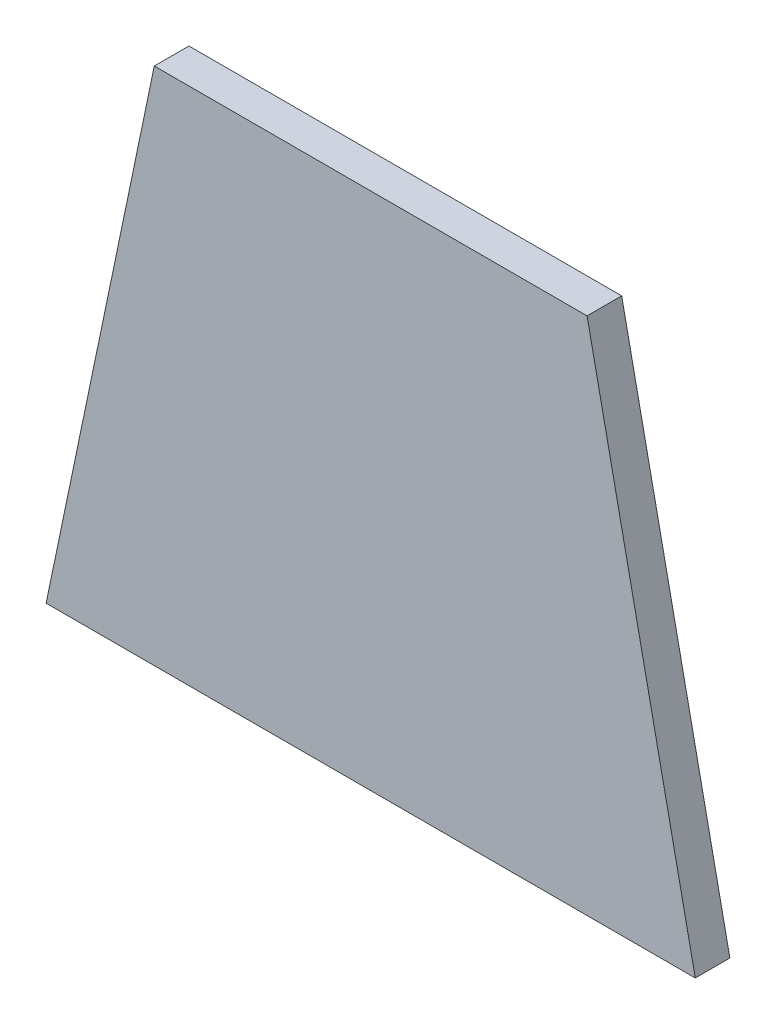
from build123d import *

# Parameters (mm, degrees)
BASE_EXTRUSION_DEPTH = 8


with BuildPart() as part:
    # Esquisse1 → Base-Extrusion (new body)
    with BuildSketch(Plane.XY):
        Polygon((0, 0), (25, 120), (125, 120), (150, 0), align=None)
    extrude(amount=BASE_EXTRUSION_DEPTH)


solid = part.part
